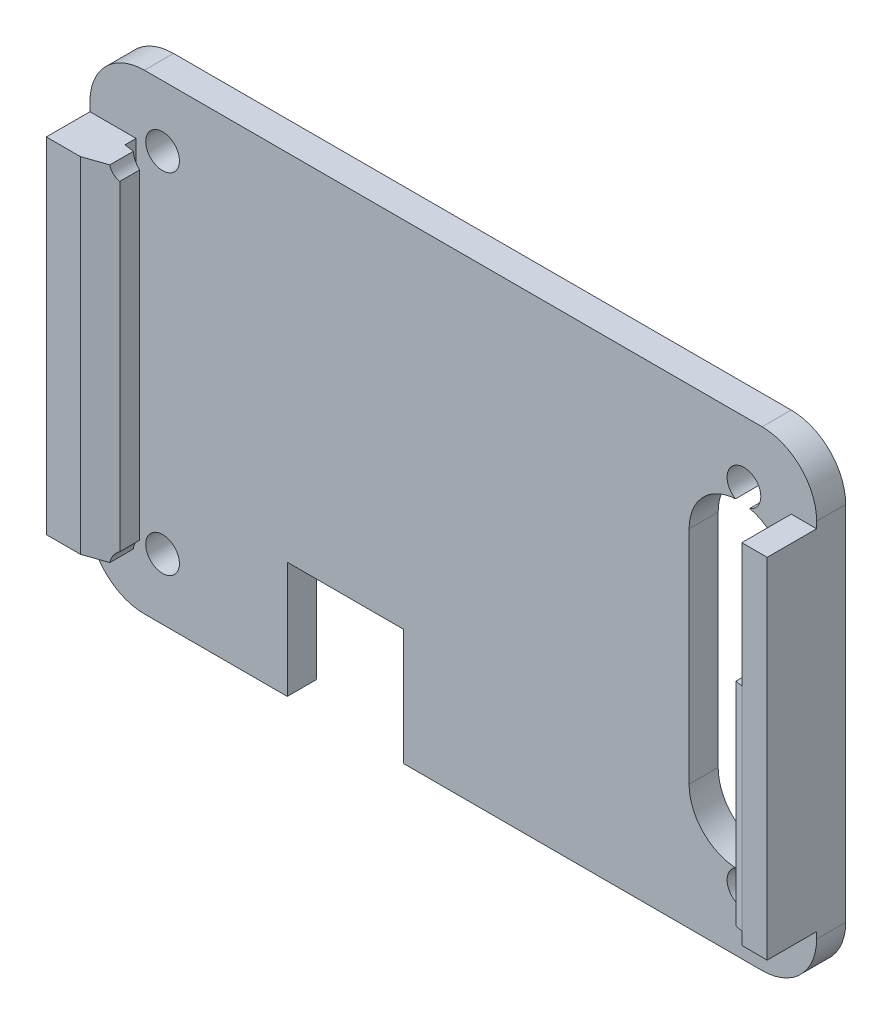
from build123d import *

# Parameters (mm, degrees)
SKETCH1_W               = 63.5
SKETCH1_H               = 41.148
BOSS_EXTRUDE1_DEPTH     = 2.54
SKETCH2_W               = 5.5372
SKETCH2_H               = 30.099
BOSS_EXTRUDE2_DEPTH     = 3.81
CUT_EXTRUDE1_DEPTH      = 39.362409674
CUT_EXTRUDE1_DEPTH_BACK = 39.362409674
FILLET1_R               = 4.7625
SKETCH4_W               = 10.16
SKETCH4_H               = 10.16
CUT_EXTRUDE2_DEPTH      = 4.318
CUT_EXTRUDE3_DEPTH      = 4.318
SKETCH6_W               = 2.218674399
SKETCH6_H               = 30.48
BOSS_EXTRUDE3_DEPTH     = 4.318
BOSS_EXTRUDE4_DEPTH     = 9.271
F_4_CLEARANCE_HOLE1_D   = 2.9464


with BuildPart() as part:
    # Sketch1 → Boss-Extrude1 (new body)
    with BuildSketch(Plane.XY):
        Rectangle(SKETCH1_W, SKETCH1_H)
    extrude(amount=BOSS_EXTRUDE1_DEPTH)

    # Sketch2 → Boss-Extrude2 (add)
    with BuildSketch(Plane.XY.offset(2.54)):
        with Locations((-28.9814, 0)):
            Rectangle(SKETCH2_W, SKETCH2_H)
    extrude(amount=BOSS_EXTRUDE2_DEPTH)

    # Sketch3 → Cut-Extrude1 (cut, two sides: drawn at the far end of the back side and taken through both)
    with BuildSketch(Plane(origin=(0, 0, 0), x_dir=(1, 0, 0), z_dir=(0, 1, 0)).offset(-CUT_EXTRUDE1_DEPTH_BACK)):
        Polygon((-26.2128, -2.54), (-27.7114, -2.54), (-27.7114, -3.509758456), (-26.2128, -3.73686203), align=None)
        Polygon((-26.2128, -5.464438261), (-28.770980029, -6.35), (-26.2128, -6.35), align=None)
    extrude(amount=CUT_EXTRUDE1_DEPTH + CUT_EXTRUDE1_DEPTH_BACK, mode=Mode.SUBTRACT)

    # Fillet1
    fillet1_edges = [part.edges().sort_by_distance(p)[0] for p in [
        (-31.75, -20.574, 1.27),
        (31.75, -20.574, 1.27),
        (31.75, 20.574, 1.27),
        (-31.75, 20.574, 1.27),
    ]]
    fillet(fillet1_edges, radius=FILLET1_R)

    # Sketch4 → Cut-Extrude2 (cut)
    with BuildSketch(Plane.XY.offset(2.54)):
        with Locations((-9.4234, -15.494)):
            Rectangle(SKETCH4_W, SKETCH4_H)
    extrude(amount=-CUT_EXTRUDE2_DEPTH, mode=Mode.SUBTRACT)

    # Sketch5 → Cut-Extrude3 (cut)
    with BuildSketch(Plane(origin=(0, 0, 0), x_dir=(-1, 0, 0), z_dir=(0, 0, -1))):
        with BuildLine():
            Line((-20.606840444, 9.664438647), (-20.606840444, -9.664438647))
            ThreePointArc((-20.606840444, -9.664438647), (-24.912936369, -13.970534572), (-29.219032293, -9.664438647))
            Line((-29.219032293, -9.664438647), (-29.219032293, 9.664438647))
            ThreePointArc((-29.219032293, 9.664438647), (-24.912936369, 13.970534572), (-20.606840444, 9.664438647))
        make_face()
    extrude(amount=-CUT_EXTRUDE3_DEPTH, mode=Mode.SUBTRACT)

    # Sketch6 → Boss-Extrude3 (add)
    with BuildSketch(Plane.XY.offset(2.54)):
        with Locations((30.640662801, 0)):
            Rectangle(SKETCH6_W, SKETCH6_H)
    extrude(amount=BOSS_EXTRUDE3_DEPTH)

    # Sketch8 → Boss-Extrude4 (add, symmetric)
    with BuildSketch(Plane(origin=(0, -4.8895, 0), x_dir=(-1, 0, 0), z_dir=(0, -1, 0))):
        Polygon((-29.531325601, -5.461), (-28.896325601, -5.717687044), (-28.896325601, -6.712729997), (-29.531325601, -6.858), (-31.75, -6.858), (-31.75, -2.54), (-29.531325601, -2.54), align=None)
    extrude(amount=BOSS_EXTRUDE4_DEPTH, both=True)

    # 4 Clearance Hole1 (through all)
    with Locations(Plane(origin=(0, 0, 0), x_dir=(-1, 0, 0), z_dir=(0, 0, -1))):
        with Locations((-25.4, 15.24), (25.4, -15.24), (-25.4, -15.24), (25.4, 15.24)):
            Hole(F_4_CLEARANCE_HOLE1_D / 2)


solid = part.part
